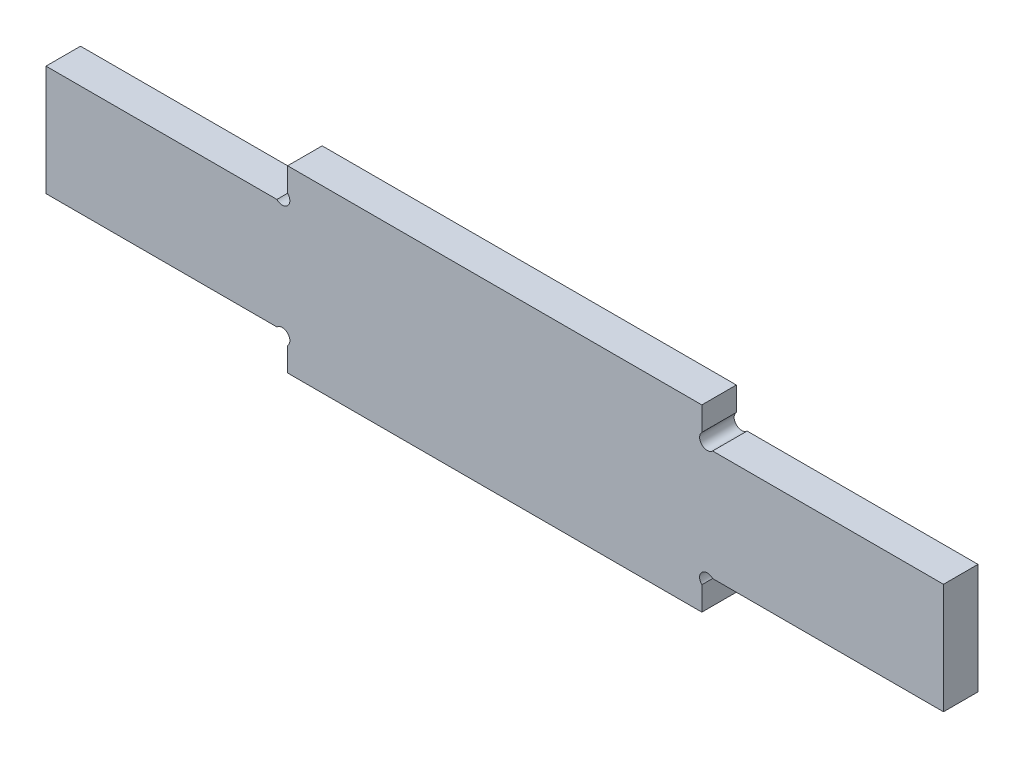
ISO-10303-21;
HEADER;
FILE_DESCRIPTION(('STEP AP214'),'2;1');
FILE_NAME('part.step','',(''),(''),'','','');
FILE_SCHEMA(('AUTOMOTIVE_DESIGN { 1 0 10303 214 1 1 1 1 }'));
ENDSEC;
DATA;
#1=APPLICATION_CONTEXT('core data for automotive mechanical design processes');
#2=APPLICATION_PROTOCOL_DEFINITION('international standard','automotive_design',2000,#1);
#3=PRODUCT_CONTEXT('',#1,'mechanical');
#4=PRODUCT('Part','Part','',(#3));
#5=PRODUCT_RELATED_PRODUCT_CATEGORY('part','',(#4));
#6=PRODUCT_DEFINITION_FORMATION('','',#4);
#7=PRODUCT_DEFINITION_CONTEXT('part definition',#1,'design');
#8=PRODUCT_DEFINITION('design','',#6,#7);
#9=PRODUCT_DEFINITION_SHAPE('','',#8);
#10=(LENGTH_UNIT() NAMED_UNIT(*) SI_UNIT(.MILLI.,.METRE.));
#11=(NAMED_UNIT(*) PLANE_ANGLE_UNIT() SI_UNIT($,.RADIAN.));
#12=(NAMED_UNIT(*) SI_UNIT($,.STERADIAN.) SOLID_ANGLE_UNIT());
#13=UNCERTAINTY_MEASURE_WITH_UNIT(LENGTH_MEASURE(1.E-05),#10,'distance_accuracy_value','');
#14=(GEOMETRIC_REPRESENTATION_CONTEXT(3) GLOBAL_UNCERTAINTY_ASSIGNED_CONTEXT((#13)) GLOBAL_UNIT_ASSIGNED_CONTEXT((#10,
#11,#12)) REPRESENTATION_CONTEXT('',''));
#15=CARTESIAN_POINT('',(0.,0.,0.));
#16=DIRECTION('',(0.,0.,1.));
#17=DIRECTION('',(1.,0.,0.));
#18=AXIS2_PLACEMENT_3D('',#15,#16,#17);
#19=CARTESIAN_POINT('',(0.,26.,5.));
#20=DIRECTION('',(0.,0.,-1.));
#21=DIRECTION('',(-1.,0.,0.));
#22=AXIS2_PLACEMENT_3D('',#19,#20,#21);
#23=PLANE('',#22);
#24=DIRECTION('',(0.,1.,0.));
#25=VECTOR('',#24,1.);
#26=CARTESIAN_POINT('',(95.,0.,5.));
#27=LINE('',#26,#25);
#28=CARTESIAN_POINT('',(95.,0.,5.));
#29=VERTEX_POINT('',#28);
#30=CARTESIAN_POINT('',(95.,3.4443650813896,5.));
#31=VERTEX_POINT('',#30);
#32=EDGE_CURVE('E50',#29,#31,#27,.T.);
#33=ORIENTED_EDGE('',*,*,#32,.T.);
#34=CARTESIAN_POINT('',(95.7778174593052,4.2221825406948,5.));
#35=DIRECTION('',(0.,0.,-1.));
#36=DIRECTION('',(-1.,0.,0.));
#37=AXIS2_PLACEMENT_3D('',#34,#35,#36);
#38=CIRCLE('',#37,1.1);
#39=CARTESIAN_POINT('',(96.5556349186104,5.,5.));
#40=VERTEX_POINT('',#39);
#41=EDGE_CURVE('E161',#31,#40,#38,.T.);
#42=ORIENTED_EDGE('',*,*,#41,.T.);
#43=DIRECTION('',(1.,0.,0.));
#44=VECTOR('',#43,1.);
#45=CARTESIAN_POINT('',(130.,5.,5.));
#46=LINE('',#45,#44);
#47=CARTESIAN_POINT('',(130.,5.,5.));
#48=VERTEX_POINT('',#47);
#49=EDGE_CURVE('E170',#40,#48,#46,.T.);
#50=ORIENTED_EDGE('',*,*,#49,.T.);
#51=DIRECTION('',(0.,-1.,0.));
#52=VECTOR('',#51,1.);
#53=CARTESIAN_POINT('',(130.,0.,5.));
#54=LINE('',#53,#52);
#55=CARTESIAN_POINT('',(130.,21.,5.));
#56=VERTEX_POINT('',#55);
#57=EDGE_CURVE('E198',#56,#48,#54,.T.);
#58=ORIENTED_EDGE('',*,*,#57,.F.);
#59=DIRECTION('',(-1.,0.,0.));
#60=VECTOR('',#59,1.);
#61=CARTESIAN_POINT('',(130.,21.,5.));
#62=LINE('',#61,#60);
#63=CARTESIAN_POINT('',(96.5556349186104,21.,5.));
#64=VERTEX_POINT('',#63);
#65=EDGE_CURVE('E58',#56,#64,#62,.T.);
#66=ORIENTED_EDGE('',*,*,#65,.T.);
#67=CARTESIAN_POINT('',(95.7778174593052,21.7778174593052,5.));
#68=DIRECTION('',(0.,0.,-1.));
#69=DIRECTION('',(-1.,0.,0.));
#70=AXIS2_PLACEMENT_3D('',#67,#68,#69);
#71=CIRCLE('',#70,1.1);
#72=CARTESIAN_POINT('',(95.,22.5556349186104,5.));
#73=VERTEX_POINT('',#72);
#74=EDGE_CURVE('E174',#64,#73,#71,.T.);
#75=ORIENTED_EDGE('',*,*,#74,.T.);
#76=DIRECTION('',(0.,1.,0.));
#77=VECTOR('',#76,1.);
#78=CARTESIAN_POINT('',(95.,26.,5.));
#79=LINE('',#78,#77);
#80=CARTESIAN_POINT('',(95.,26.,5.));
#81=VERTEX_POINT('',#80);
#82=EDGE_CURVE('E189',#73,#81,#79,.T.);
#83=ORIENTED_EDGE('',*,*,#82,.T.);
#84=DIRECTION('',(-1.,0.,0.));
#85=VECTOR('',#84,1.);
#86=CARTESIAN_POINT('',(0.,26.,5.));
#87=LINE('',#86,#85);
#88=CARTESIAN_POINT('',(35.,26.,5.));
#89=VERTEX_POINT('',#88);
#90=EDGE_CURVE('E11',#81,#89,#87,.T.);
#91=ORIENTED_EDGE('',*,*,#90,.T.);
#92=DIRECTION('',(0.,1.,0.));
#93=VECTOR('',#92,1.);
#94=CARTESIAN_POINT('',(35.,26.,5.));
#95=LINE('',#94,#93);
#96=CARTESIAN_POINT('',(35.,22.5556349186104,5.));
#97=VERTEX_POINT('',#96);
#98=EDGE_CURVE('E241',#97,#89,#95,.T.);
#99=ORIENTED_EDGE('',*,*,#98,.F.);
#100=CARTESIAN_POINT('',(34.2221825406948,21.7778174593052,5.));
#101=DIRECTION('',(0.,0.,1.));
#102=DIRECTION('',(1.,0.,0.));
#103=AXIS2_PLACEMENT_3D('',#100,#101,#102);
#104=CIRCLE('',#103,1.1);
#105=CARTESIAN_POINT('',(33.4443650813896,21.,5.));
#106=VERTEX_POINT('',#105);
#107=EDGE_CURVE('E216',#106,#97,#104,.T.);
#108=ORIENTED_EDGE('',*,*,#107,.F.);
#109=DIRECTION('',(1.,0.,0.));
#110=VECTOR('',#109,1.);
#111=CARTESIAN_POINT('',(0.,21.,5.));
#112=LINE('',#111,#110);
#113=CARTESIAN_POINT('',(0.,21.,5.));
#114=VERTEX_POINT('',#113);
#115=EDGE_CURVE('E238',#114,#106,#112,.T.);
#116=ORIENTED_EDGE('',*,*,#115,.F.);
#117=DIRECTION('',(0.,-1.,0.));
#118=VECTOR('',#117,1.);
#119=CARTESIAN_POINT('',(0.,0.,5.));
#120=LINE('',#119,#118);
#121=CARTESIAN_POINT('',(0.,5.,5.));
#122=VERTEX_POINT('',#121);
#123=EDGE_CURVE('E253',#114,#122,#120,.T.);
#124=ORIENTED_EDGE('',*,*,#123,.T.);
#125=DIRECTION('',(-1.,0.,0.));
#126=VECTOR('',#125,1.);
#127=CARTESIAN_POINT('',(0.,5.,5.));
#128=LINE('',#127,#126);
#129=CARTESIAN_POINT('',(33.4443650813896,5.,5.));
#130=VERTEX_POINT('',#129);
#131=EDGE_CURVE('E228',#130,#122,#128,.T.);
#132=ORIENTED_EDGE('',*,*,#131,.F.);
#133=CARTESIAN_POINT('',(34.2221825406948,4.2221825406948,5.));
#134=DIRECTION('',(0.,0.,1.));
#135=DIRECTION('',(1.,0.,0.));
#136=AXIS2_PLACEMENT_3D('',#133,#134,#135);
#137=CIRCLE('',#136,1.1);
#138=CARTESIAN_POINT('',(35.,3.4443650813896,5.));
#139=VERTEX_POINT('',#138);
#140=EDGE_CURVE('E210',#139,#130,#137,.T.);
#141=ORIENTED_EDGE('',*,*,#140,.F.);
#142=DIRECTION('',(0.,1.,0.));
#143=VECTOR('',#142,1.);
#144=CARTESIAN_POINT('',(35.,0.,5.));
#145=LINE('',#144,#143);
#146=CARTESIAN_POINT('',(35.,0.,5.));
#147=VERTEX_POINT('',#146);
#148=EDGE_CURVE('E225',#147,#139,#145,.T.);
#149=ORIENTED_EDGE('',*,*,#148,.F.);
#150=DIRECTION('',(1.,0.,0.));
#151=VECTOR('',#150,1.);
#152=CARTESIAN_POINT('',(0.,0.,5.));
#153=LINE('',#152,#151);
#154=EDGE_CURVE('E42',#147,#29,#153,.T.);
#155=ORIENTED_EDGE('',*,*,#154,.T.);
#156=EDGE_LOOP('',(#33,#42,#50,#58,#66,#75,#83,#91,#99,#108,#116,#124,#132,#141,#149,#155));
#157=FACE_BOUND('',#156,.T.);
#158=ADVANCED_FACE('F33',(#157),#23,.F.);
#159=CARTESIAN_POINT('',(0.,26.,0.));
#160=DIRECTION('',(0.,0.,-1.));
#161=DIRECTION('',(-1.,0.,0.));
#162=AXIS2_PLACEMENT_3D('',#159,#160,#161);
#163=PLANE('',#162);
#164=CARTESIAN_POINT('',(95.7778174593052,4.2221825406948,0.));
#165=DIRECTION('',(0.,0.,-1.));
#166=DIRECTION('',(-1.,0.,0.));
#167=AXIS2_PLACEMENT_3D('',#164,#165,#166);
#168=CIRCLE('',#167,1.1);
#169=CARTESIAN_POINT('',(95.,3.4443650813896,0.));
#170=VERTEX_POINT('',#169);
#171=CARTESIAN_POINT('',(96.5556349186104,5.,0.));
#172=VERTEX_POINT('',#171);
#173=EDGE_CURVE('E149',#170,#172,#168,.T.);
#174=ORIENTED_EDGE('',*,*,#173,.F.);
#175=DIRECTION('',(0.,1.,0.));
#176=VECTOR('',#175,1.);
#177=CARTESIAN_POINT('',(95.,0.,0.));
#178=LINE('',#177,#176);
#179=CARTESIAN_POINT('',(95.,0.,0.));
#180=VERTEX_POINT('',#179);
#181=EDGE_CURVE('E154',#180,#170,#178,.T.);
#182=ORIENTED_EDGE('',*,*,#181,.F.);
#183=DIRECTION('',(1.,0.,0.));
#184=VECTOR('',#183,1.);
#185=CARTESIAN_POINT('',(0.,0.,0.));
#186=LINE('',#185,#184);
#187=CARTESIAN_POINT('',(35.,0.,0.));
#188=VERTEX_POINT('',#187);
#189=EDGE_CURVE('E259',#188,#180,#186,.T.);
#190=ORIENTED_EDGE('',*,*,#189,.F.);
#191=DIRECTION('',(0.,1.,0.));
#192=VECTOR('',#191,1.);
#193=CARTESIAN_POINT('',(35.,0.,0.));
#194=LINE('',#193,#192);
#195=CARTESIAN_POINT('',(35.,3.4443650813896,0.));
#196=VERTEX_POINT('',#195);
#197=EDGE_CURVE('E220',#188,#196,#194,.T.);
#198=ORIENTED_EDGE('',*,*,#197,.T.);
#199=CARTESIAN_POINT('',(34.2221825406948,4.2221825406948,0.));
#200=DIRECTION('',(0.,0.,-1.));
#201=DIRECTION('',(-1.,0.,0.));
#202=AXIS2_PLACEMENT_3D('',#199,#200,#201);
#203=CIRCLE('',#202,1.1);
#204=CARTESIAN_POINT('',(33.4443650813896,5.,0.));
#205=VERTEX_POINT('',#204);
#206=EDGE_CURVE('E212',#196,#205,#203,.F.);
#207=ORIENTED_EDGE('',*,*,#206,.T.);
#208=DIRECTION('',(-1.,0.,0.));
#209=VECTOR('',#208,1.);
#210=CARTESIAN_POINT('',(0.,5.,0.));
#211=LINE('',#210,#209);
#212=CARTESIAN_POINT('',(0.,5.,0.));
#213=VERTEX_POINT('',#212);
#214=EDGE_CURVE('E223',#205,#213,#211,.T.);
#215=ORIENTED_EDGE('',*,*,#214,.T.);
#216=DIRECTION('',(0.,-1.,0.));
#217=VECTOR('',#216,1.);
#218=CARTESIAN_POINT('',(0.,0.,0.));
#219=LINE('',#218,#217);
#220=CARTESIAN_POINT('',(0.,21.,0.));
#221=VERTEX_POINT('',#220);
#222=EDGE_CURVE('E252',#221,#213,#219,.T.);
#223=ORIENTED_EDGE('',*,*,#222,.F.);
#224=DIRECTION('',(1.,0.,0.));
#225=VECTOR('',#224,1.);
#226=CARTESIAN_POINT('',(0.,21.,0.));
#227=LINE('',#226,#225);
#228=CARTESIAN_POINT('',(33.4443650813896,21.,0.));
#229=VERTEX_POINT('',#228);
#230=EDGE_CURVE('E248',#221,#229,#227,.T.);
#231=ORIENTED_EDGE('',*,*,#230,.T.);
#232=CARTESIAN_POINT('',(34.2221825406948,21.7778174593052,0.));
#233=DIRECTION('',(0.,0.,-1.));
#234=DIRECTION('',(-1.,0.,0.));
#235=AXIS2_PLACEMENT_3D('',#232,#233,#234);
#236=CIRCLE('',#235,1.1);
#237=CARTESIAN_POINT('',(35.,22.5556349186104,0.));
#238=VERTEX_POINT('',#237);
#239=EDGE_CURVE('E218',#229,#238,#236,.F.);
#240=ORIENTED_EDGE('',*,*,#239,.T.);
#241=DIRECTION('',(0.,1.,0.));
#242=VECTOR('',#241,1.);
#243=CARTESIAN_POINT('',(35.,26.,0.));
#244=LINE('',#243,#242);
#245=CARTESIAN_POINT('',(35.,26.,0.));
#246=VERTEX_POINT('',#245);
#247=EDGE_CURVE('E234',#238,#246,#244,.T.);
#248=ORIENTED_EDGE('',*,*,#247,.T.);
#249=DIRECTION('',(-1.,0.,0.));
#250=VECTOR('',#249,1.);
#251=CARTESIAN_POINT('',(0.,26.,0.));
#252=LINE('',#251,#250);
#253=CARTESIAN_POINT('',(95.,26.,0.));
#254=VERTEX_POINT('',#253);
#255=EDGE_CURVE('E37',#254,#246,#252,.T.);
#256=ORIENTED_EDGE('',*,*,#255,.F.);
#257=DIRECTION('',(0.,1.,0.));
#258=VECTOR('',#257,1.);
#259=CARTESIAN_POINT('',(95.,26.,0.));
#260=LINE('',#259,#258);
#261=CARTESIAN_POINT('',(95.,22.5556349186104,0.));
#262=VERTEX_POINT('',#261);
#263=EDGE_CURVE('E184',#262,#254,#260,.T.);
#264=ORIENTED_EDGE('',*,*,#263,.F.);
#265=CARTESIAN_POINT('',(95.7778174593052,21.7778174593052,0.));
#266=DIRECTION('',(0.,0.,-1.));
#267=DIRECTION('',(-1.,0.,0.));
#268=AXIS2_PLACEMENT_3D('',#265,#266,#267);
#269=CIRCLE('',#268,1.1);
#270=CARTESIAN_POINT('',(96.5556349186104,21.,0.));
#271=VERTEX_POINT('',#270);
#272=EDGE_CURVE('E171',#271,#262,#269,.T.);
#273=ORIENTED_EDGE('',*,*,#272,.F.);
#274=DIRECTION('',(-1.,0.,0.));
#275=VECTOR('',#274,1.);
#276=CARTESIAN_POINT('',(130.,21.,0.));
#277=LINE('',#276,#275);
#278=CARTESIAN_POINT('',(130.,21.,0.));
#279=VERTEX_POINT('',#278);
#280=EDGE_CURVE('E186',#279,#271,#277,.T.);
#281=ORIENTED_EDGE('',*,*,#280,.F.);
#282=DIRECTION('',(0.,-1.,0.));
#283=VECTOR('',#282,1.);
#284=CARTESIAN_POINT('',(130.,0.,0.));
#285=LINE('',#284,#283);
#286=CARTESIAN_POINT('',(130.,5.,0.));
#287=VERTEX_POINT('',#286);
#288=EDGE_CURVE('E195',#279,#287,#285,.T.);
#289=ORIENTED_EDGE('',*,*,#288,.T.);
#290=DIRECTION('',(1.,0.,0.));
#291=VECTOR('',#290,1.);
#292=CARTESIAN_POINT('',(130.,5.,0.));
#293=LINE('',#292,#291);
#294=EDGE_CURVE('E157',#172,#287,#293,.T.);
#295=ORIENTED_EDGE('',*,*,#294,.F.);
#296=EDGE_LOOP('',(#174,#182,#190,#198,#207,#215,#223,#231,#240,#248,#256,#264,#273,#281,#289,#295));
#297=FACE_BOUND('',#296,.T.);
#298=ADVANCED_FACE('F151',(#297),#163,.T.);
#299=CARTESIAN_POINT('',(95.,0.,-0.00100000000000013));
#300=DIRECTION('',(1.,0.,0.));
#301=DIRECTION('',(0.,0.,-1.));
#302=AXIS2_PLACEMENT_3D('',#299,#300,#301);
#303=PLANE('',#302);
#304=ORIENTED_EDGE('',*,*,#181,.T.);
#305=DIRECTION('',(0.,0.,1.));
#306=VECTOR('',#305,1.);
#307=CARTESIAN_POINT('',(95.,3.4443650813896,-0.00100000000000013));
#308=LINE('',#307,#306);
#309=EDGE_CURVE('E163',#31,#170,#308,.F.);
#310=ORIENTED_EDGE('',*,*,#309,.F.);
#311=ORIENTED_EDGE('',*,*,#32,.F.);
#312=DIRECTION('',(0.,0.,1.));
#313=VECTOR('',#312,1.);
#314=CARTESIAN_POINT('',(95.,0.,-0.00100000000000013));
#315=LINE('',#314,#313);
#316=EDGE_CURVE('E169',#180,#29,#315,.T.);
#317=ORIENTED_EDGE('',*,*,#316,.F.);
#318=EDGE_LOOP('',(#304,#310,#311,#317));
#319=FACE_BOUND('',#318,.T.);
#320=ADVANCED_FACE('F168',(#319),#303,.T.);
#321=CARTESIAN_POINT('',(130.,21.,-0.00100000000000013));
#322=DIRECTION('',(0.,1.,0.));
#323=DIRECTION('',(0.,0.,1.));
#324=AXIS2_PLACEMENT_3D('',#321,#322,#323);
#325=PLANE('',#324);
#326=ORIENTED_EDGE('',*,*,#280,.T.);
#327=DIRECTION('',(0.,0.,1.));
#328=VECTOR('',#327,1.);
#329=CARTESIAN_POINT('',(96.5556349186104,21.,-0.00100000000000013));
#330=LINE('',#329,#328);
#331=EDGE_CURVE('E166',#64,#271,#330,.F.);
#332=ORIENTED_EDGE('',*,*,#331,.F.);
#333=ORIENTED_EDGE('',*,*,#65,.F.);
#334=DIRECTION('',(0.,0.,1.));
#335=VECTOR('',#334,1.);
#336=CARTESIAN_POINT('',(130.,21.,-0.00100000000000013));
#337=LINE('',#336,#335);
#338=EDGE_CURVE('E193',#279,#56,#337,.T.);
#339=ORIENTED_EDGE('',*,*,#338,.F.);
#340=EDGE_LOOP('',(#326,#332,#333,#339));
#341=FACE_BOUND('',#340,.T.);
#342=ADVANCED_FACE('F289',(#341),#325,.T.);
#343=CARTESIAN_POINT('',(130.,5.,-0.00100000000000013));
#344=DIRECTION('',(0.,-1.,0.));
#345=DIRECTION('',(0.,0.,-1.));
#346=AXIS2_PLACEMENT_3D('',#343,#344,#345);
#347=PLANE('',#346);
#348=ORIENTED_EDGE('',*,*,#49,.F.);
#349=DIRECTION('',(0.,0.,1.));
#350=VECTOR('',#349,1.);
#351=CARTESIAN_POINT('',(96.5556349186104,5.,-0.00100000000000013));
#352=LINE('',#351,#350);
#353=EDGE_CURVE('E287',#172,#40,#352,.T.);
#354=ORIENTED_EDGE('',*,*,#353,.F.);
#355=ORIENTED_EDGE('',*,*,#294,.T.);
#356=DIRECTION('',(0.,0.,1.));
#357=VECTOR('',#356,1.);
#358=CARTESIAN_POINT('',(130.,5.,-0.00100000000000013));
#359=LINE('',#358,#357);
#360=EDGE_CURVE('E179',#287,#48,#359,.T.);
#361=ORIENTED_EDGE('',*,*,#360,.T.);
#362=EDGE_LOOP('',(#348,#354,#355,#361));
#363=FACE_BOUND('',#362,.T.);
#364=ADVANCED_FACE('F296',(#363),#347,.T.);
#365=CARTESIAN_POINT('',(95.,26.,-0.00100000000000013));
#366=DIRECTION('',(1.,0.,0.));
#367=DIRECTION('',(0.,0.,-1.));
#368=AXIS2_PLACEMENT_3D('',#365,#366,#367);
#369=PLANE('',#368);
#370=ORIENTED_EDGE('',*,*,#82,.F.);
#371=DIRECTION('',(0.,0.,1.));
#372=VECTOR('',#371,1.);
#373=CARTESIAN_POINT('',(95.,22.5556349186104,-0.00100000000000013));
#374=LINE('',#373,#372);
#375=EDGE_CURVE('E160',#262,#73,#374,.T.);
#376=ORIENTED_EDGE('',*,*,#375,.F.);
#377=ORIENTED_EDGE('',*,*,#263,.T.);
#378=DIRECTION('',(0.,0.,1.));
#379=VECTOR('',#378,1.);
#380=CARTESIAN_POINT('',(95.,26.,-0.00100000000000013));
#381=LINE('',#380,#379);
#382=EDGE_CURVE('E192',#254,#81,#381,.T.);
#383=ORIENTED_EDGE('',*,*,#382,.T.);
#384=EDGE_LOOP('',(#370,#376,#377,#383));
#385=FACE_BOUND('',#384,.T.);
#386=ADVANCED_FACE('F281',(#385),#369,.T.);
#387=CARTESIAN_POINT('',(130.,0.,5.));
#388=DIRECTION('',(1.,0.,0.));
#389=DIRECTION('',(0.,0.,-1.));
#390=AXIS2_PLACEMENT_3D('',#387,#388,#389);
#391=PLANE('',#390);
#392=ORIENTED_EDGE('',*,*,#57,.T.);
#393=ORIENTED_EDGE('',*,*,#360,.F.);
#394=ORIENTED_EDGE('',*,*,#288,.F.);
#395=ORIENTED_EDGE('',*,*,#338,.T.);
#396=EDGE_LOOP('',(#392,#393,#394,#395));
#397=FACE_BOUND('',#396,.T.);
#398=ADVANCED_FACE('F292',(#397),#391,.T.);
#399=CARTESIAN_POINT('',(0.,0.,5.));
#400=DIRECTION('',(0.,1.,0.));
#401=DIRECTION('',(0.,0.,1.));
#402=AXIS2_PLACEMENT_3D('',#399,#400,#401);
#403=PLANE('',#402);
#404=ORIENTED_EDGE('',*,*,#316,.T.);
#405=ORIENTED_EDGE('',*,*,#154,.F.);
#406=DIRECTION('',(0.,0.,1.));
#407=VECTOR('',#406,1.);
#408=CARTESIAN_POINT('',(35.,0.,-0.00100000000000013));
#409=LINE('',#408,#407);
#410=EDGE_CURVE('E230',#188,#147,#409,.T.);
#411=ORIENTED_EDGE('',*,*,#410,.F.);
#412=ORIENTED_EDGE('',*,*,#189,.T.);
#413=EDGE_LOOP('',(#404,#405,#411,#412));
#414=FACE_BOUND('',#413,.T.);
#415=ADVANCED_FACE('F320',(#414),#403,.F.);
#416=CARTESIAN_POINT('',(0.,26.,5.));
#417=DIRECTION('',(0.,-1.,0.));
#418=DIRECTION('',(0.,0.,-1.));
#419=AXIS2_PLACEMENT_3D('',#416,#417,#418);
#420=PLANE('',#419);
#421=ORIENTED_EDGE('',*,*,#382,.F.);
#422=ORIENTED_EDGE('',*,*,#255,.T.);
#423=DIRECTION('',(0.,0.,1.));
#424=VECTOR('',#423,1.);
#425=CARTESIAN_POINT('',(35.,26.,-0.00100000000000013));
#426=LINE('',#425,#424);
#427=EDGE_CURVE('E245',#246,#89,#426,.T.);
#428=ORIENTED_EDGE('',*,*,#427,.T.);
#429=ORIENTED_EDGE('',*,*,#90,.F.);
#430=EDGE_LOOP('',(#421,#422,#428,#429));
#431=FACE_BOUND('',#430,.T.);
#432=ADVANCED_FACE('F265',(#431),#420,.F.);
#433=CARTESIAN_POINT('',(0.,0.,5.));
#434=DIRECTION('',(1.,0.,0.));
#435=DIRECTION('',(0.,0.,-1.));
#436=AXIS2_PLACEMENT_3D('',#433,#434,#435);
#437=PLANE('',#436);
#438=ORIENTED_EDGE('',*,*,#222,.T.);
#439=DIRECTION('',(0.,0.,1.));
#440=VECTOR('',#439,1.);
#441=CARTESIAN_POINT('',(0.,5.,-0.00100000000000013));
#442=LINE('',#441,#440);
#443=EDGE_CURVE('E231',#213,#122,#442,.T.);
#444=ORIENTED_EDGE('',*,*,#443,.T.);
#445=ORIENTED_EDGE('',*,*,#123,.F.);
#446=DIRECTION('',(0.,0.,1.));
#447=VECTOR('',#446,1.);
#448=CARTESIAN_POINT('',(0.,21.,-0.00100000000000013));
#449=LINE('',#448,#447);
#450=EDGE_CURVE('E244',#221,#114,#449,.T.);
#451=ORIENTED_EDGE('',*,*,#450,.F.);
#452=EDGE_LOOP('',(#438,#444,#445,#451));
#453=FACE_BOUND('',#452,.T.);
#454=ADVANCED_FACE('F35',(#453),#437,.F.);
#455=CARTESIAN_POINT('',(35.,26.,-0.00100000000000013));
#456=DIRECTION('',(1.,0.,0.));
#457=DIRECTION('',(0.,0.,-1.));
#458=AXIS2_PLACEMENT_3D('',#455,#456,#457);
#459=PLANE('',#458);
#460=ORIENTED_EDGE('',*,*,#247,.F.);
#461=DIRECTION('',(0.,0.,1.));
#462=VECTOR('',#461,1.);
#463=CARTESIAN_POINT('',(35.,22.5556349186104,-0.00100000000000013));
#464=LINE('',#463,#462);
#465=EDGE_CURVE('E205',#97,#238,#464,.F.);
#466=ORIENTED_EDGE('',*,*,#465,.F.);
#467=ORIENTED_EDGE('',*,*,#98,.T.);
#468=ORIENTED_EDGE('',*,*,#427,.F.);
#469=EDGE_LOOP('',(#460,#466,#467,#468));
#470=FACE_BOUND('',#469,.T.);
#471=ADVANCED_FACE('F272',(#470),#459,.F.);
#472=CARTESIAN_POINT('',(0.,21.,-0.00100000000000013));
#473=DIRECTION('',(0.,-1.,0.));
#474=DIRECTION('',(0.,0.,-1.));
#475=AXIS2_PLACEMENT_3D('',#472,#473,#474);
#476=PLANE('',#475);
#477=ORIENTED_EDGE('',*,*,#115,.T.);
#478=DIRECTION('',(0.,0.,1.));
#479=VECTOR('',#478,1.);
#480=CARTESIAN_POINT('',(33.4443650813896,21.,-0.00100000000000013));
#481=LINE('',#480,#479);
#482=EDGE_CURVE('E214',#229,#106,#481,.T.);
#483=ORIENTED_EDGE('',*,*,#482,.F.);
#484=ORIENTED_EDGE('',*,*,#230,.F.);
#485=ORIENTED_EDGE('',*,*,#450,.T.);
#486=EDGE_LOOP('',(#477,#483,#484,#485));
#487=FACE_BOUND('',#486,.T.);
#488=ADVANCED_FACE('F316',(#487),#476,.F.);
#489=CARTESIAN_POINT('',(0.,5.,-0.00100000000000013));
#490=DIRECTION('',(0.,1.,0.));
#491=DIRECTION('',(0.,0.,1.));
#492=AXIS2_PLACEMENT_3D('',#489,#490,#491);
#493=PLANE('',#492);
#494=ORIENTED_EDGE('',*,*,#214,.F.);
#495=DIRECTION('',(0.,0.,1.));
#496=VECTOR('',#495,1.);
#497=CARTESIAN_POINT('',(33.4443650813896,5.,-0.00100000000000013));
#498=LINE('',#497,#496);
#499=EDGE_CURVE('E201',#130,#205,#498,.F.);
#500=ORIENTED_EDGE('',*,*,#499,.F.);
#501=ORIENTED_EDGE('',*,*,#131,.T.);
#502=ORIENTED_EDGE('',*,*,#443,.F.);
#503=EDGE_LOOP('',(#494,#500,#501,#502));
#504=FACE_BOUND('',#503,.T.);
#505=ADVANCED_FACE('F340',(#504),#493,.F.);
#506=CARTESIAN_POINT('',(35.,0.,-0.00100000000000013));
#507=DIRECTION('',(1.,0.,0.));
#508=DIRECTION('',(0.,0.,-1.));
#509=AXIS2_PLACEMENT_3D('',#506,#507,#508);
#510=PLANE('',#509);
#511=ORIENTED_EDGE('',*,*,#148,.T.);
#512=DIRECTION('',(0.,0.,1.));
#513=VECTOR('',#512,1.);
#514=CARTESIAN_POINT('',(35.,3.4443650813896,-0.00100000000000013));
#515=LINE('',#514,#513);
#516=EDGE_CURVE('E208',#196,#139,#515,.T.);
#517=ORIENTED_EDGE('',*,*,#516,.F.);
#518=ORIENTED_EDGE('',*,*,#197,.F.);
#519=ORIENTED_EDGE('',*,*,#410,.T.);
#520=EDGE_LOOP('',(#511,#517,#518,#519));
#521=FACE_BOUND('',#520,.T.);
#522=ADVANCED_FACE('F332',(#521),#510,.F.);
#523=CARTESIAN_POINT('',(34.2221825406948,21.7778174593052,-0.00100000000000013));
#524=DIRECTION('',(0.,0.,1.));
#525=DIRECTION('',(1.,0.,0.));
#526=AXIS2_PLACEMENT_3D('',#523,#524,#525);
#527=CYLINDRICAL_SURFACE('',#526,1.1);
#528=ORIENTED_EDGE('',*,*,#107,.T.);
#529=ORIENTED_EDGE('',*,*,#465,.T.);
#530=ORIENTED_EDGE('',*,*,#239,.F.);
#531=ORIENTED_EDGE('',*,*,#482,.T.);
#532=EDGE_LOOP('',(#528,#529,#530,#531));
#533=FACE_BOUND('',#532,.T.);
#534=ADVANCED_FACE('F347',(#533),#527,.F.);
#535=CARTESIAN_POINT('',(34.2221825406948,4.2221825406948,-0.00100000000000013));
#536=DIRECTION('',(0.,0.,1.));
#537=DIRECTION('',(1.,0.,0.));
#538=AXIS2_PLACEMENT_3D('',#535,#536,#537);
#539=CYLINDRICAL_SURFACE('',#538,1.1);
#540=ORIENTED_EDGE('',*,*,#140,.T.);
#541=ORIENTED_EDGE('',*,*,#499,.T.);
#542=ORIENTED_EDGE('',*,*,#206,.F.);
#543=ORIENTED_EDGE('',*,*,#516,.T.);
#544=EDGE_LOOP('',(#540,#541,#542,#543));
#545=FACE_BOUND('',#544,.T.);
#546=ADVANCED_FACE('F338',(#545),#539,.F.);
#547=CARTESIAN_POINT('',(95.7778174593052,21.7778174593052,-0.00100000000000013));
#548=DIRECTION('',(0.,0.,1.));
#549=DIRECTION('',(1.,0.,0.));
#550=AXIS2_PLACEMENT_3D('',#547,#548,#549);
#551=CYLINDRICAL_SURFACE('',#550,1.1);
#552=ORIENTED_EDGE('',*,*,#375,.T.);
#553=ORIENTED_EDGE('',*,*,#74,.F.);
#554=ORIENTED_EDGE('',*,*,#331,.T.);
#555=ORIENTED_EDGE('',*,*,#272,.T.);
#556=EDGE_LOOP('',(#552,#553,#554,#555));
#557=FACE_BOUND('',#556,.T.);
#558=ADVANCED_FACE('F286',(#557),#551,.F.);
#559=CARTESIAN_POINT('',(95.7778174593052,4.2221825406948,-0.00100000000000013));
#560=DIRECTION('',(0.,0.,1.));
#561=DIRECTION('',(1.,0.,0.));
#562=AXIS2_PLACEMENT_3D('',#559,#560,#561);
#563=CYLINDRICAL_SURFACE('',#562,1.1);
#564=ORIENTED_EDGE('',*,*,#173,.T.);
#565=ORIENTED_EDGE('',*,*,#353,.T.);
#566=ORIENTED_EDGE('',*,*,#41,.F.);
#567=ORIENTED_EDGE('',*,*,#309,.T.);
#568=EDGE_LOOP('',(#564,#565,#566,#567));
#569=FACE_BOUND('',#568,.T.);
#570=ADVANCED_FACE('F164',(#569),#563,.F.);
#571=CLOSED_SHELL('',(#158,#298,#320,#342,#364,#386,#398,#415,#432,#454,#471,#488,#505,#522,
#534,#546,#558,#570));
#572=MANIFOLD_SOLID_BREP('B2',#571);
#573=ADVANCED_BREP_SHAPE_REPRESENTATION('',(#18,#572),#14);
#574=SHAPE_DEFINITION_REPRESENTATION(#9,#573);
ENDSEC;
END-ISO-10303-21;
